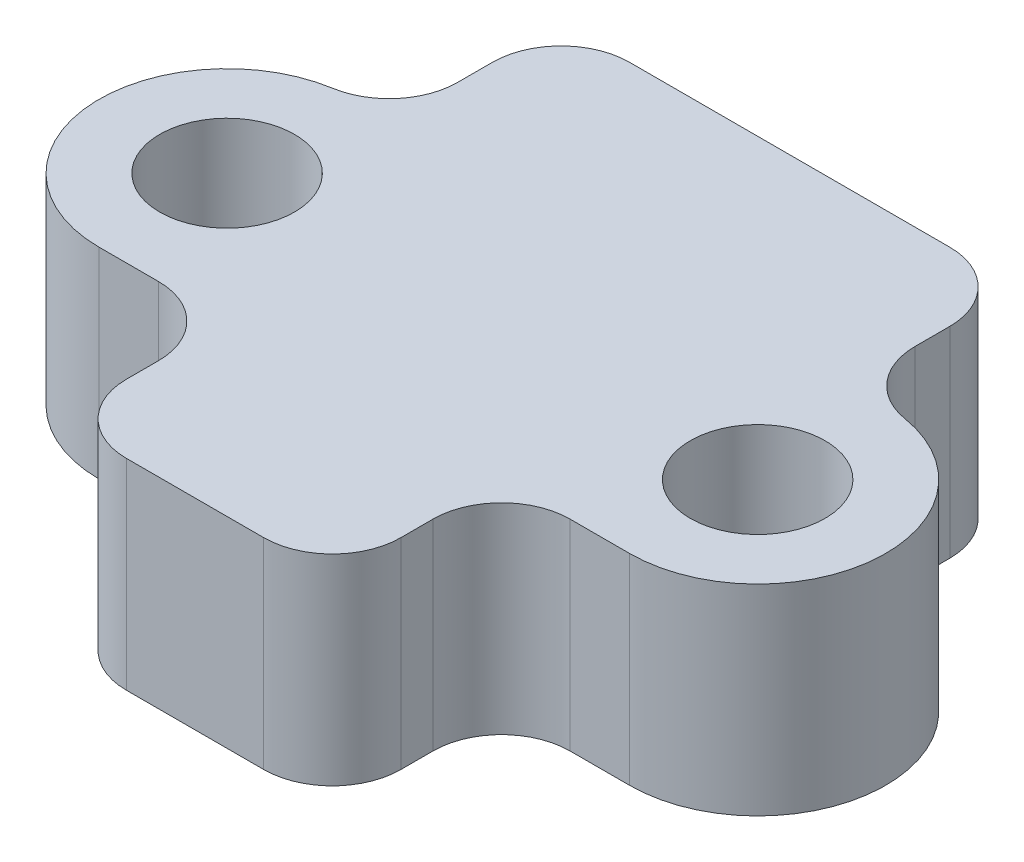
ISO-10303-21;
HEADER;
FILE_DESCRIPTION(('STEP AP214'),'2;1');
FILE_NAME('part.step','',(''),(''),'','','');
FILE_SCHEMA(('AUTOMOTIVE_DESIGN { 1 0 10303 214 1 1 1 1 }'));
ENDSEC;
DATA;
#1=APPLICATION_CONTEXT('core data for automotive mechanical design processes');
#2=APPLICATION_PROTOCOL_DEFINITION('international standard','automotive_design',2000,#1);
#3=PRODUCT_CONTEXT('',#1,'mechanical');
#4=PRODUCT('Part','Part','',(#3));
#5=PRODUCT_RELATED_PRODUCT_CATEGORY('part','',(#4));
#6=PRODUCT_DEFINITION_FORMATION('','',#4);
#7=PRODUCT_DEFINITION_CONTEXT('part definition',#1,'design');
#8=PRODUCT_DEFINITION('design','',#6,#7);
#9=PRODUCT_DEFINITION_SHAPE('','',#8);
#10=(LENGTH_UNIT() NAMED_UNIT(*) SI_UNIT(.MILLI.,.METRE.));
#11=(NAMED_UNIT(*) PLANE_ANGLE_UNIT() SI_UNIT($,.RADIAN.));
#12=(NAMED_UNIT(*) SI_UNIT($,.STERADIAN.) SOLID_ANGLE_UNIT());
#13=UNCERTAINTY_MEASURE_WITH_UNIT(LENGTH_MEASURE(1.E-05),#10,'distance_accuracy_value','');
#14=(GEOMETRIC_REPRESENTATION_CONTEXT(3) GLOBAL_UNCERTAINTY_ASSIGNED_CONTEXT((#13)) GLOBAL_UNIT_ASSIGNED_CONTEXT((#10,
#11,#12)) REPRESENTATION_CONTEXT('',''));
#15=CARTESIAN_POINT('',(0.,0.,0.));
#16=DIRECTION('',(0.,0.,1.));
#17=DIRECTION('',(1.,0.,0.));
#18=AXIS2_PLACEMENT_3D('',#15,#16,#17);
#19=CARTESIAN_POINT('',(-39.2,-5.5873454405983,4.42));
#20=DIRECTION('',(0.,0.,1.));
#21=DIRECTION('',(1.,0.,0.));
#22=AXIS2_PLACEMENT_3D('',#19,#20,#21);
#23=PLANE('',#22);
#24=DIRECTION('',(-1.,0.,0.));
#25=VECTOR('',#24,1.);
#26=CARTESIAN_POINT('',(-39.2,10.,4.42));
#27=LINE('',#26,#25);
#28=CARTESIAN_POINT('',(-40.7,10.,4.42));
#29=VERTEX_POINT('',#28);
#30=CARTESIAN_POINT('',(-43.7,10.,4.42));
#31=VERTEX_POINT('',#30);
#32=EDGE_CURVE('E273',#29,#31,#27,.T.);
#33=ORIENTED_EDGE('',*,*,#32,.F.);
#34=DIRECTION('',(0.,1.,0.));
#35=VECTOR('',#34,1.);
#36=CARTESIAN_POINT('',(-40.7,-5.5873454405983,4.42));
#37=LINE('',#36,#35);
#38=CARTESIAN_POINT('',(-40.7,14.391,4.42));
#39=VERTEX_POINT('',#38);
#40=EDGE_CURVE('E288',#29,#39,#37,.T.);
#41=ORIENTED_EDGE('',*,*,#40,.T.);
#42=DIRECTION('',(1.,0.,0.));
#43=VECTOR('',#42,1.);
#44=CARTESIAN_POINT('',(-39.2,14.391,4.42));
#45=LINE('',#44,#43);
#46=CARTESIAN_POINT('',(-43.7,14.391,4.42));
#47=VERTEX_POINT('',#46);
#48=EDGE_CURVE('E248',#47,#39,#45,.T.);
#49=ORIENTED_EDGE('',*,*,#48,.F.);
#50=DIRECTION('',(0.,1.,0.));
#51=VECTOR('',#50,1.);
#52=CARTESIAN_POINT('',(-43.7,-5.5873454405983,4.42));
#53=LINE('',#52,#51);
#54=EDGE_CURVE('E212',#31,#47,#53,.T.);
#55=ORIENTED_EDGE('',*,*,#54,.F.);
#56=EDGE_LOOP('',(#33,#41,#49,#55));
#57=FACE_BOUND('',#56,.T.);
#58=ADVANCED_FACE('F37',(#57),#23,.T.);
#59=CARTESIAN_POINT('',(-42.2,-5.5873454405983,-8.58));
#60=DIRECTION('',(0.,0.,-1.));
#61=DIRECTION('',(-1.,0.,0.));
#62=AXIS2_PLACEMENT_3D('',#59,#60,#61);
#63=PLANE('',#62);
#64=DIRECTION('',(-1.,0.,0.));
#65=VECTOR('',#64,1.);
#66=CARTESIAN_POINT('',(-42.2,14.391,-8.58));
#67=LINE('',#66,#65);
#68=CARTESIAN_POINT('',(-38.7,14.391,-8.58));
#69=VERTEX_POINT('',#68);
#70=CARTESIAN_POINT('',(-45.7,14.391,-8.58));
#71=VERTEX_POINT('',#70);
#72=EDGE_CURVE('E261',#69,#71,#67,.T.);
#73=ORIENTED_EDGE('',*,*,#72,.F.);
#74=DIRECTION('',(0.,1.,0.));
#75=VECTOR('',#74,1.);
#76=CARTESIAN_POINT('',(-38.7,-5.5873454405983,-8.58));
#77=LINE('',#76,#75);
#78=CARTESIAN_POINT('',(-38.7,10.,-8.58));
#79=VERTEX_POINT('',#78);
#80=EDGE_CURVE('E60',#69,#79,#77,.F.);
#81=ORIENTED_EDGE('',*,*,#80,.T.);
#82=DIRECTION('',(1.,0.,0.));
#83=VECTOR('',#82,1.);
#84=CARTESIAN_POINT('',(-42.2,10.,-8.58));
#85=LINE('',#84,#83);
#86=CARTESIAN_POINT('',(-45.7,10.,-8.58));
#87=VERTEX_POINT('',#86);
#88=EDGE_CURVE('E271',#87,#79,#85,.T.);
#89=ORIENTED_EDGE('',*,*,#88,.F.);
#90=DIRECTION('',(0.,1.,0.));
#91=VECTOR('',#90,1.);
#92=CARTESIAN_POINT('',(-45.7,-5.5873454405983,-8.58));
#93=LINE('',#92,#91);
#94=EDGE_CURVE('E232',#71,#87,#93,.F.);
#95=ORIENTED_EDGE('',*,*,#94,.F.);
#96=EDGE_LOOP('',(#73,#81,#89,#95));
#97=FACE_BOUND('',#96,.T.);
#98=ADVANCED_FACE('F368',(#97),#63,.T.);
#99=CARTESIAN_POINT('',(-37.2,-5.5873454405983,-8.58));
#100=DIRECTION('',(1.,0.,0.));
#101=DIRECTION('',(0.,0.,-1.));
#102=AXIS2_PLACEMENT_3D('',#99,#100,#101);
#103=PLANE('',#102);
#104=DIRECTION('',(0.,0.,-1.));
#105=VECTOR('',#104,1.);
#106=CARTESIAN_POINT('',(-37.2,14.391,-8.58));
#107=LINE('',#106,#105);
#108=CARTESIAN_POINT('',(-37.2,14.391,-6.32269187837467));
#109=VERTEX_POINT('',#108);
#110=CARTESIAN_POINT('',(-37.2,14.391,-7.08));
#111=VERTEX_POINT('',#110);
#112=EDGE_CURVE('E258',#109,#111,#107,.T.);
#113=ORIENTED_EDGE('',*,*,#112,.F.);
#114=DIRECTION('',(0.,-1.,0.));
#115=VECTOR('',#114,1.);
#116=CARTESIAN_POINT('',(-37.2,10.,-6.32269187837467));
#117=LINE('',#116,#115);
#118=CARTESIAN_POINT('',(-37.2,10.,-6.32269187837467));
#119=VERTEX_POINT('',#118);
#120=EDGE_CURVE('E286',#109,#119,#117,.T.);
#121=ORIENTED_EDGE('',*,*,#120,.T.);
#122=DIRECTION('',(0.,0.,1.));
#123=VECTOR('',#122,1.);
#124=CARTESIAN_POINT('',(-37.2,10.,-8.58));
#125=LINE('',#124,#123);
#126=CARTESIAN_POINT('',(-37.2,10.,-7.08));
#127=VERTEX_POINT('',#126);
#128=EDGE_CURVE('E268',#127,#119,#125,.T.);
#129=ORIENTED_EDGE('',*,*,#128,.F.);
#130=DIRECTION('',(0.,1.,0.));
#131=VECTOR('',#130,1.);
#132=CARTESIAN_POINT('',(-37.2,-5.5873454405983,-7.08));
#133=LINE('',#132,#131);
#134=EDGE_CURVE('E283',#127,#111,#133,.T.);
#135=ORIENTED_EDGE('',*,*,#134,.T.);
#136=EDGE_LOOP('',(#113,#121,#129,#135));
#137=FACE_BOUND('',#136,.T.);
#138=ADVANCED_FACE('F373',(#137),#103,.T.);
#139=CARTESIAN_POINT('',(-36.3996896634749,-5.5873454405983,-2.08));
#140=DIRECTION('',(0.,1.,0.));
#141=DIRECTION('',(0.,0.,1.));
#142=AXIS2_PLACEMENT_3D('',#139,#140,#141);
#143=CYLINDRICAL_SURFACE('',#142,2.8);
#144=CARTESIAN_POINT('',(-36.3996896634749,10.,-2.08));
#145=DIRECTION('',(0.,1.,0.));
#146=DIRECTION('',(0.,0.,1.));
#147=AXIS2_PLACEMENT_3D('',#144,#145,#146);
#148=CIRCLE('',#147,2.8);
#149=CARTESIAN_POINT('',(-35.9440777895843,10.,-4.8426830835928));
#150=VERTEX_POINT('',#149);
#151=CARTESIAN_POINT('',(-36.3996896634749,10.,0.720000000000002));
#152=VERTEX_POINT('',#151);
#153=EDGE_CURVE('E266',#150,#152,#148,.F.);
#154=ORIENTED_EDGE('',*,*,#153,.F.);
#155=DIRECTION('',(0.,1.,0.));
#156=VECTOR('',#155,1.);
#157=CARTESIAN_POINT('',(-35.9440777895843,-5.5873454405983,-4.84268308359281));
#158=LINE('',#157,#156);
#159=CARTESIAN_POINT('',(-35.9440777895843,14.391,-4.8426830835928));
#160=VERTEX_POINT('',#159);
#161=EDGE_CURVE('E280',#150,#160,#158,.T.);
#162=ORIENTED_EDGE('',*,*,#161,.T.);
#163=CARTESIAN_POINT('',(-36.3996896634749,14.391,-2.08));
#164=DIRECTION('',(0.,1.,0.));
#165=DIRECTION('',(0.,0.,-1.));
#166=AXIS2_PLACEMENT_3D('',#163,#164,#165);
#167=CIRCLE('',#166,2.8);
#168=CARTESIAN_POINT('',(-36.3996896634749,14.391,0.720000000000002));
#169=VERTEX_POINT('',#168);
#170=EDGE_CURVE('E255',#169,#160,#167,.T.);
#171=ORIENTED_EDGE('',*,*,#170,.F.);
#172=DIRECTION('',(0.,1.,0.));
#173=VECTOR('',#172,1.);
#174=CARTESIAN_POINT('',(-36.3996896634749,-5.5873454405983,0.720000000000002));
#175=LINE('',#174,#173);
#176=EDGE_CURVE('E263',#152,#169,#175,.T.);
#177=ORIENTED_EDGE('',*,*,#176,.F.);
#178=EDGE_LOOP('',(#154,#162,#171,#177));
#179=FACE_BOUND('',#178,.T.);
#180=ADVANCED_FACE('F405',(#179),#143,.T.);
#181=CARTESIAN_POINT('',(-39.2,-5.5873454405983,0.720000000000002));
#182=DIRECTION('',(0.,0.,1.));
#183=DIRECTION('',(1.,0.,0.));
#184=AXIS2_PLACEMENT_3D('',#181,#182,#183);
#185=PLANE('',#184);
#186=DIRECTION('',(1.,0.,0.));
#187=VECTOR('',#186,1.);
#188=CARTESIAN_POINT('',(-39.2,14.391,0.720000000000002));
#189=LINE('',#188,#187);
#190=CARTESIAN_POINT('',(-37.7,14.391,0.720000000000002));
#191=VERTEX_POINT('',#190);
#192=EDGE_CURVE('E253',#191,#169,#189,.T.);
#193=ORIENTED_EDGE('',*,*,#192,.F.);
#194=DIRECTION('',(0.,1.,0.));
#195=VECTOR('',#194,1.);
#196=CARTESIAN_POINT('',(-37.7,10.,0.720000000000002));
#197=LINE('',#196,#195);
#198=CARTESIAN_POINT('',(-37.7,10.,0.720000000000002));
#199=VERTEX_POINT('',#198);
#200=EDGE_CURVE('E52',#191,#199,#197,.F.);
#201=ORIENTED_EDGE('',*,*,#200,.T.);
#202=DIRECTION('',(-1.,0.,0.));
#203=VECTOR('',#202,1.);
#204=CARTESIAN_POINT('',(-39.2,10.,0.720000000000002));
#205=LINE('',#204,#203);
#206=EDGE_CURVE('E264',#152,#199,#205,.T.);
#207=ORIENTED_EDGE('',*,*,#206,.F.);
#208=ORIENTED_EDGE('',*,*,#176,.T.);
#209=EDGE_LOOP('',(#193,#201,#207,#208));
#210=FACE_BOUND('',#209,.T.);
#211=ADVANCED_FACE('F312',(#210),#185,.T.);
#212=CARTESIAN_POINT('',(-39.2,-5.5873454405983,0.720000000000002));
#213=DIRECTION('',(1.,0.,0.));
#214=DIRECTION('',(0.,0.,-1.));
#215=AXIS2_PLACEMENT_3D('',#212,#213,#214);
#216=PLANE('',#215);
#217=DIRECTION('',(0.,0.,-1.));
#218=VECTOR('',#217,1.);
#219=CARTESIAN_POINT('',(-39.2,14.391,0.720000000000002));
#220=LINE('',#219,#218);
#221=CARTESIAN_POINT('',(-39.2,14.391,2.92));
#222=VERTEX_POINT('',#221);
#223=CARTESIAN_POINT('',(-39.2,14.391,2.22));
#224=VERTEX_POINT('',#223);
#225=EDGE_CURVE('E250',#222,#224,#220,.T.);
#226=ORIENTED_EDGE('',*,*,#225,.F.);
#227=DIRECTION('',(0.,1.,0.));
#228=VECTOR('',#227,1.);
#229=CARTESIAN_POINT('',(-39.2,-5.5873454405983,2.92));
#230=LINE('',#229,#228);
#231=CARTESIAN_POINT('',(-39.2,10.,2.92));
#232=VERTEX_POINT('',#231);
#233=EDGE_CURVE('E298',#222,#232,#230,.F.);
#234=ORIENTED_EDGE('',*,*,#233,.T.);
#235=DIRECTION('',(0.,0.,1.));
#236=VECTOR('',#235,1.);
#237=CARTESIAN_POINT('',(-39.2,10.,0.720000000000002));
#238=LINE('',#237,#236);
#239=CARTESIAN_POINT('',(-39.2,10.,2.22));
#240=VERTEX_POINT('',#239);
#241=EDGE_CURVE('E275',#240,#232,#238,.T.);
#242=ORIENTED_EDGE('',*,*,#241,.F.);
#243=DIRECTION('',(0.,1.,0.));
#244=VECTOR('',#243,1.);
#245=CARTESIAN_POINT('',(-39.2,14.391,2.22));
#246=LINE('',#245,#244);
#247=EDGE_CURVE('E295',#240,#224,#246,.T.);
#248=ORIENTED_EDGE('',*,*,#247,.T.);
#249=EDGE_LOOP('',(#226,#234,#242,#248));
#250=FACE_BOUND('',#249,.T.);
#251=ADVANCED_FACE('F323',(#250),#216,.T.);
#252=CARTESIAN_POINT('',(0.,10.,0.));
#253=DIRECTION('',(0.,1.,0.));
#254=DIRECTION('',(0.,0.,1.));
#255=AXIS2_PLACEMENT_3D('',#252,#253,#254);
#256=PLANE('',#255);
#257=CARTESIAN_POINT('',(-36.3996896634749,10.,-2.08));
#258=DIRECTION('',(0.,1.,0.));
#259=DIRECTION('',(0.,0.,1.));
#260=AXIS2_PLACEMENT_3D('',#257,#258,#259);
#261=CIRCLE('',#260,1.47319999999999);
#262=CARTESIAN_POINT('',(-36.3996896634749,10.,-0.606800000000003));
#263=VERTEX_POINT('',#262);
#264=EDGE_CURVE('E245',#263,#263,#261,.T.);
#265=ORIENTED_EDGE('',*,*,#264,.T.);
#266=EDGE_LOOP('',(#265));
#267=FACE_BOUND('',#266,.T.);
#268=ORIENTED_EDGE('',*,*,#241,.T.);
#269=CARTESIAN_POINT('',(-40.7,10.,2.92));
#270=DIRECTION('',(0.,1.,0.));
#271=DIRECTION('',(0.,0.,1.));
#272=AXIS2_PLACEMENT_3D('',#269,#270,#271);
#273=CIRCLE('',#272,1.5);
#274=EDGE_CURVE('E302',#232,#29,#273,.F.);
#275=ORIENTED_EDGE('',*,*,#274,.T.);
#276=ORIENTED_EDGE('',*,*,#32,.T.);
#277=CARTESIAN_POINT('',(-43.7,10.,2.92));
#278=DIRECTION('',(0.,-1.,0.));
#279=DIRECTION('',(0.,0.,1.));
#280=AXIS2_PLACEMENT_3D('',#277,#278,#279);
#281=CIRCLE('',#280,1.5);
#282=CARTESIAN_POINT('',(-45.2,10.,2.92));
#283=VERTEX_POINT('',#282);
#284=EDGE_CURVE('E228',#283,#31,#281,.F.);
#285=ORIENTED_EDGE('',*,*,#284,.F.);
#286=DIRECTION('',(0.,0.,1.));
#287=VECTOR('',#286,1.);
#288=CARTESIAN_POINT('',(-45.2,10.,0.720000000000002));
#289=LINE('',#288,#287);
#290=CARTESIAN_POINT('',(-45.2,10.,2.22));
#291=VERTEX_POINT('',#290);
#292=EDGE_CURVE('E201',#291,#283,#289,.T.);
#293=ORIENTED_EDGE('',*,*,#292,.F.);
#294=CARTESIAN_POINT('',(-46.7,10.,2.22));
#295=DIRECTION('',(0.,-1.,0.));
#296=DIRECTION('',(0.,0.,1.));
#297=AXIS2_PLACEMENT_3D('',#294,#295,#296);
#298=CIRCLE('',#297,1.5);
#299=CARTESIAN_POINT('',(-46.7,10.,0.720000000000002));
#300=VERTEX_POINT('',#299);
#301=EDGE_CURVE('E240',#300,#291,#298,.T.);
#302=ORIENTED_EDGE('',*,*,#301,.F.);
#303=DIRECTION('',(1.,0.,0.));
#304=VECTOR('',#303,1.);
#305=CARTESIAN_POINT('',(-45.2,10.,0.720000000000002));
#306=LINE('',#305,#304);
#307=CARTESIAN_POINT('',(-48.0003103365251,10.,0.720000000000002));
#308=VERTEX_POINT('',#307);
#309=EDGE_CURVE('E192',#308,#300,#306,.T.);
#310=ORIENTED_EDGE('',*,*,#309,.F.);
#311=CARTESIAN_POINT('',(-48.0003103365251,10.,-2.08));
#312=DIRECTION('',(0.,-1.,0.));
#313=DIRECTION('',(0.,0.,1.));
#314=AXIS2_PLACEMENT_3D('',#311,#312,#313);
#315=CIRCLE('',#314,2.8);
#316=CARTESIAN_POINT('',(-48.4559222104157,10.,-4.8426830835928));
#317=VERTEX_POINT('',#316);
#318=EDGE_CURVE('E191',#317,#308,#315,.F.);
#319=ORIENTED_EDGE('',*,*,#318,.F.);
#320=CARTESIAN_POINT('',(-48.7,10.,-6.32269187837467));
#321=DIRECTION('',(0.,-1.,0.));
#322=DIRECTION('',(0.,0.,1.));
#323=AXIS2_PLACEMENT_3D('',#320,#321,#322);
#324=CIRCLE('',#323,1.5);
#325=CARTESIAN_POINT('',(-47.2,10.,-6.32269187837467));
#326=VERTEX_POINT('',#325);
#327=EDGE_CURVE('E236',#326,#317,#324,.T.);
#328=ORIENTED_EDGE('',*,*,#327,.F.);
#329=DIRECTION('',(0.,0.,1.));
#330=VECTOR('',#329,1.);
#331=CARTESIAN_POINT('',(-47.2,10.,-8.58));
#332=LINE('',#331,#330);
#333=CARTESIAN_POINT('',(-47.2,10.,-7.08));
#334=VERTEX_POINT('',#333);
#335=EDGE_CURVE('E199',#334,#326,#332,.T.);
#336=ORIENTED_EDGE('',*,*,#335,.F.);
#337=CARTESIAN_POINT('',(-45.7,10.,-7.08));
#338=DIRECTION('',(0.,-1.,0.));
#339=DIRECTION('',(0.,0.,1.));
#340=AXIS2_PLACEMENT_3D('',#337,#338,#339);
#341=CIRCLE('',#340,1.5);
#342=EDGE_CURVE('E226',#87,#334,#341,.F.);
#343=ORIENTED_EDGE('',*,*,#342,.F.);
#344=ORIENTED_EDGE('',*,*,#88,.T.);
#345=CARTESIAN_POINT('',(-38.7,10.,-7.08));
#346=DIRECTION('',(0.,1.,0.));
#347=DIRECTION('',(0.,0.,1.));
#348=AXIS2_PLACEMENT_3D('',#345,#346,#347);
#349=CIRCLE('',#348,1.5);
#350=EDGE_CURVE('E300',#79,#127,#349,.F.);
#351=ORIENTED_EDGE('',*,*,#350,.T.);
#352=ORIENTED_EDGE('',*,*,#128,.T.);
#353=CARTESIAN_POINT('',(-35.7,10.,-6.32269187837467));
#354=DIRECTION('',(0.,1.,0.));
#355=DIRECTION('',(0.,0.,1.));
#356=AXIS2_PLACEMENT_3D('',#353,#354,#355);
#357=CIRCLE('',#356,1.5);
#358=EDGE_CURVE('E308',#119,#150,#357,.T.);
#359=ORIENTED_EDGE('',*,*,#358,.T.);
#360=ORIENTED_EDGE('',*,*,#153,.T.);
#361=ORIENTED_EDGE('',*,*,#206,.T.);
#362=CARTESIAN_POINT('',(-37.7,10.,2.22));
#363=DIRECTION('',(0.,1.,0.));
#364=DIRECTION('',(0.,0.,1.));
#365=AXIS2_PLACEMENT_3D('',#362,#363,#364);
#366=CIRCLE('',#365,1.5);
#367=EDGE_CURVE('E11',#199,#240,#366,.T.);
#368=ORIENTED_EDGE('',*,*,#367,.T.);
#369=EDGE_LOOP('',(#268,#275,#276,#285,#293,#302,#310,#319,#328,#336,#343,#344,#351,#352,#359,
#360,#361,#368));
#370=FACE_BOUND('',#369,.T.);
#371=CARTESIAN_POINT('',(-48.0003103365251,10.,-2.08));
#372=DIRECTION('',(0.,-1.,0.));
#373=DIRECTION('',(0.,0.,1.));
#374=AXIS2_PLACEMENT_3D('',#371,#372,#373);
#375=CIRCLE('',#374,1.47319999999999);
#376=CARTESIAN_POINT('',(-48.0003103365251,10.,-0.606800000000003));
#377=VERTEX_POINT('',#376);
#378=EDGE_CURVE('E347',#377,#377,#375,.T.);
#379=ORIENTED_EDGE('',*,*,#378,.F.);
#380=EDGE_LOOP('',(#379));
#381=FACE_BOUND('',#380,.T.);
#382=ADVANCED_FACE('F319',(#267,#370,#381),#256,.F.);
#383=CARTESIAN_POINT('',(-36.3996896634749,14.391,-2.08));
#384=DIRECTION('',(0.,-1.,0.));
#385=DIRECTION('',(0.,0.,-1.));
#386=AXIS2_PLACEMENT_3D('',#383,#384,#385);
#387=PLANE('',#386);
#388=CARTESIAN_POINT('',(-36.3996896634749,14.391,-2.08));
#389=DIRECTION('',(0.,1.,0.));
#390=DIRECTION('',(0.,0.,1.));
#391=AXIS2_PLACEMENT_3D('',#388,#389,#390);
#392=CIRCLE('',#391,1.47319999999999);
#393=CARTESIAN_POINT('',(-36.3996896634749,14.391,-0.60680000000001));
#394=VERTEX_POINT('',#393);
#395=EDGE_CURVE('E242',#394,#394,#392,.T.);
#396=ORIENTED_EDGE('',*,*,#395,.F.);
#397=EDGE_LOOP('',(#396));
#398=FACE_BOUND('',#397,.T.);
#399=ORIENTED_EDGE('',*,*,#48,.T.);
#400=CARTESIAN_POINT('',(-40.7,14.391,2.92));
#401=DIRECTION('',(0.,-1.,0.));
#402=DIRECTION('',(0.,0.,-1.));
#403=AXIS2_PLACEMENT_3D('',#400,#401,#402);
#404=CIRCLE('',#403,1.5);
#405=EDGE_CURVE('E293',#39,#222,#404,.F.);
#406=ORIENTED_EDGE('',*,*,#405,.T.);
#407=ORIENTED_EDGE('',*,*,#225,.T.);
#408=CARTESIAN_POINT('',(-37.7,14.391,2.22));
#409=DIRECTION('',(0.,-1.,0.));
#410=DIRECTION('',(0.,0.,-1.));
#411=AXIS2_PLACEMENT_3D('',#408,#409,#410);
#412=CIRCLE('',#411,1.5);
#413=EDGE_CURVE('E45',#224,#191,#412,.T.);
#414=ORIENTED_EDGE('',*,*,#413,.T.);
#415=ORIENTED_EDGE('',*,*,#192,.T.);
#416=ORIENTED_EDGE('',*,*,#170,.T.);
#417=CARTESIAN_POINT('',(-35.7,14.391,-6.32269187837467));
#418=DIRECTION('',(0.,-1.,0.));
#419=DIRECTION('',(0.,0.,-1.));
#420=AXIS2_PLACEMENT_3D('',#417,#418,#419);
#421=CIRCLE('',#420,1.5);
#422=EDGE_CURVE('E306',#160,#109,#421,.T.);
#423=ORIENTED_EDGE('',*,*,#422,.T.);
#424=ORIENTED_EDGE('',*,*,#112,.T.);
#425=CARTESIAN_POINT('',(-38.7,14.391,-7.08));
#426=DIRECTION('',(0.,-1.,0.));
#427=DIRECTION('',(0.,0.,-1.));
#428=AXIS2_PLACEMENT_3D('',#425,#426,#427);
#429=CIRCLE('',#428,1.5);
#430=EDGE_CURVE('E291',#111,#69,#429,.F.);
#431=ORIENTED_EDGE('',*,*,#430,.T.);
#432=ORIENTED_EDGE('',*,*,#72,.T.);
#433=CARTESIAN_POINT('',(-45.7,14.391,-7.08));
#434=DIRECTION('',(0.,1.,0.));
#435=DIRECTION('',(0.,0.,-1.));
#436=AXIS2_PLACEMENT_3D('',#433,#434,#435);
#437=CIRCLE('',#436,1.5);
#438=CARTESIAN_POINT('',(-47.2,14.391,-7.08));
#439=VERTEX_POINT('',#438);
#440=EDGE_CURVE('E215',#439,#71,#437,.F.);
#441=ORIENTED_EDGE('',*,*,#440,.F.);
#442=DIRECTION('',(0.,0.,-1.));
#443=VECTOR('',#442,1.);
#444=CARTESIAN_POINT('',(-47.2,14.391,-8.58));
#445=LINE('',#444,#443);
#446=CARTESIAN_POINT('',(-47.2,14.391,-6.32269187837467));
#447=VERTEX_POINT('',#446);
#448=EDGE_CURVE('E187',#447,#439,#445,.T.);
#449=ORIENTED_EDGE('',*,*,#448,.F.);
#450=CARTESIAN_POINT('',(-48.7,14.391,-6.32269187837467));
#451=DIRECTION('',(0.,1.,0.));
#452=DIRECTION('',(0.,0.,-1.));
#453=AXIS2_PLACEMENT_3D('',#450,#451,#452);
#454=CIRCLE('',#453,1.5);
#455=CARTESIAN_POINT('',(-48.4559222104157,14.391,-4.8426830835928));
#456=VERTEX_POINT('',#455);
#457=EDGE_CURVE('E183',#456,#447,#454,.T.);
#458=ORIENTED_EDGE('',*,*,#457,.F.);
#459=CARTESIAN_POINT('',(-48.0003103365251,14.391,-2.08));
#460=DIRECTION('',(0.,-1.,0.));
#461=DIRECTION('',(0.,0.,-1.));
#462=AXIS2_PLACEMENT_3D('',#459,#460,#461);
#463=CIRCLE('',#462,2.8);
#464=CARTESIAN_POINT('',(-48.0003103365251,14.391,0.720000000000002));
#465=VERTEX_POINT('',#464);
#466=EDGE_CURVE('E175',#465,#456,#463,.T.);
#467=ORIENTED_EDGE('',*,*,#466,.F.);
#468=DIRECTION('',(-1.,0.,0.));
#469=VECTOR('',#468,1.);
#470=CARTESIAN_POINT('',(-45.2,14.391,0.720000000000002));
#471=LINE('',#470,#469);
#472=CARTESIAN_POINT('',(-46.7,14.391,0.720000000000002));
#473=VERTEX_POINT('',#472);
#474=EDGE_CURVE('E165',#473,#465,#471,.T.);
#475=ORIENTED_EDGE('',*,*,#474,.F.);
#476=CARTESIAN_POINT('',(-46.7,14.391,2.22));
#477=DIRECTION('',(0.,1.,0.));
#478=DIRECTION('',(0.,0.,-1.));
#479=AXIS2_PLACEMENT_3D('',#476,#477,#478);
#480=CIRCLE('',#479,1.5);
#481=CARTESIAN_POINT('',(-45.2,14.391,2.22));
#482=VERTEX_POINT('',#481);
#483=EDGE_CURVE('E238',#482,#473,#480,.T.);
#484=ORIENTED_EDGE('',*,*,#483,.F.);
#485=DIRECTION('',(0.,0.,-1.));
#486=VECTOR('',#485,1.);
#487=CARTESIAN_POINT('',(-45.2,14.391,0.720000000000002));
#488=LINE('',#487,#486);
#489=CARTESIAN_POINT('',(-45.2,14.391,2.92));
#490=VERTEX_POINT('',#489);
#491=EDGE_CURVE('E176',#490,#482,#488,.T.);
#492=ORIENTED_EDGE('',*,*,#491,.F.);
#493=CARTESIAN_POINT('',(-43.7,14.391,2.92));
#494=DIRECTION('',(0.,1.,0.));
#495=DIRECTION('',(0.,0.,-1.));
#496=AXIS2_PLACEMENT_3D('',#493,#494,#495);
#497=CIRCLE('',#496,1.5);
#498=EDGE_CURVE('E218',#47,#490,#497,.F.);
#499=ORIENTED_EDGE('',*,*,#498,.F.);
#500=EDGE_LOOP('',(#399,#406,#407,#414,#415,#416,#423,#424,#431,#432,#441,#449,#458,#467,#475,
#484,#492,#499));
#501=FACE_BOUND('',#500,.T.);
#502=CARTESIAN_POINT('',(-48.0003103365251,14.391,-2.08));
#503=DIRECTION('',(0.,-1.,0.));
#504=DIRECTION('',(0.,0.,1.));
#505=AXIS2_PLACEMENT_3D('',#502,#503,#504);
#506=CIRCLE('',#505,1.47319999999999);
#507=CARTESIAN_POINT('',(-48.0003103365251,14.391,-0.60680000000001));
#508=VERTEX_POINT('',#507);
#509=EDGE_CURVE('E350',#508,#508,#506,.T.);
#510=ORIENTED_EDGE('',*,*,#509,.T.);
#511=EDGE_LOOP('',(#510));
#512=FACE_BOUND('',#511,.T.);
#513=ADVANCED_FACE('F180',(#398,#501,#512),#387,.F.);
#514=CARTESIAN_POINT('',(-36.3996896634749,14.391,-2.08));
#515=DIRECTION('',(0.,1.,0.));
#516=DIRECTION('',(0.,0.,1.));
#517=AXIS2_PLACEMENT_3D('',#514,#515,#516);
#518=CYLINDRICAL_SURFACE('',#517,1.47319999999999);
#519=ORIENTED_EDGE('',*,*,#264,.F.);
#520=EDGE_LOOP('',(#519));
#521=FACE_BOUND('',#520,.T.);
#522=ORIENTED_EDGE('',*,*,#395,.T.);
#523=EDGE_LOOP('',(#522));
#524=FACE_BOUND('',#523,.T.);
#525=ADVANCED_FACE('F381',(#521,#524),#518,.F.);
#526=CARTESIAN_POINT('',(-35.7,-5.5873454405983,-6.32269187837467));
#527=DIRECTION('',(0.,1.,0.));
#528=DIRECTION('',(0.,0.,1.));
#529=AXIS2_PLACEMENT_3D('',#526,#527,#528);
#530=CYLINDRICAL_SURFACE('',#529,1.5);
#531=ORIENTED_EDGE('',*,*,#358,.F.);
#532=ORIENTED_EDGE('',*,*,#120,.F.);
#533=ORIENTED_EDGE('',*,*,#422,.F.);
#534=ORIENTED_EDGE('',*,*,#161,.F.);
#535=EDGE_LOOP('',(#531,#532,#533,#534));
#536=FACE_BOUND('',#535,.T.);
#537=ADVANCED_FACE('F378',(#536),#530,.F.);
#538=CARTESIAN_POINT('',(-40.7,-5.5873454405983,2.92));
#539=DIRECTION('',(0.,1.,0.));
#540=DIRECTION('',(0.,0.,1.));
#541=AXIS2_PLACEMENT_3D('',#538,#539,#540);
#542=CYLINDRICAL_SURFACE('',#541,1.5);
#543=ORIENTED_EDGE('',*,*,#274,.F.);
#544=ORIENTED_EDGE('',*,*,#233,.F.);
#545=ORIENTED_EDGE('',*,*,#405,.F.);
#546=ORIENTED_EDGE('',*,*,#40,.F.);
#547=EDGE_LOOP('',(#543,#544,#545,#546));
#548=FACE_BOUND('',#547,.T.);
#549=ADVANCED_FACE('F326',(#548),#542,.T.);
#550=CARTESIAN_POINT('',(-37.7,-5.5873454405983,2.22));
#551=DIRECTION('',(0.,-1.,0.));
#552=DIRECTION('',(0.,0.,-1.));
#553=AXIS2_PLACEMENT_3D('',#550,#551,#552);
#554=CYLINDRICAL_SURFACE('',#553,1.5);
#555=ORIENTED_EDGE('',*,*,#367,.F.);
#556=ORIENTED_EDGE('',*,*,#200,.F.);
#557=ORIENTED_EDGE('',*,*,#413,.F.);
#558=ORIENTED_EDGE('',*,*,#247,.F.);
#559=EDGE_LOOP('',(#555,#556,#557,#558));
#560=FACE_BOUND('',#559,.T.);
#561=ADVANCED_FACE('F316',(#560),#554,.F.);
#562=CARTESIAN_POINT('',(-38.7,-5.5873454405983,-7.08));
#563=DIRECTION('',(0.,1.,0.));
#564=DIRECTION('',(0.,0.,1.));
#565=AXIS2_PLACEMENT_3D('',#562,#563,#564);
#566=CYLINDRICAL_SURFACE('',#565,1.5);
#567=ORIENTED_EDGE('',*,*,#350,.F.);
#568=ORIENTED_EDGE('',*,*,#80,.F.);
#569=ORIENTED_EDGE('',*,*,#430,.F.);
#570=ORIENTED_EDGE('',*,*,#134,.F.);
#571=EDGE_LOOP('',(#567,#568,#569,#570));
#572=FACE_BOUND('',#571,.T.);
#573=ADVANCED_FACE('F39',(#572),#566,.T.);
#574=CARTESIAN_POINT('',(-47.2,-5.5873454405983,-8.58));
#575=DIRECTION('',(-1.,0.,0.));
#576=DIRECTION('',(0.,0.,-1.));
#577=AXIS2_PLACEMENT_3D('',#574,#575,#576);
#578=PLANE('',#577);
#579=ORIENTED_EDGE('',*,*,#448,.T.);
#580=DIRECTION('',(0.,1.,0.));
#581=VECTOR('',#580,1.);
#582=CARTESIAN_POINT('',(-47.2,-5.5873454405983,-7.08));
#583=LINE('',#582,#581);
#584=EDGE_CURVE('E206',#334,#439,#583,.T.);
#585=ORIENTED_EDGE('',*,*,#584,.F.);
#586=ORIENTED_EDGE('',*,*,#335,.T.);
#587=DIRECTION('',(0.,-1.,0.));
#588=VECTOR('',#587,1.);
#589=CARTESIAN_POINT('',(-47.2,10.,-6.32269187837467));
#590=LINE('',#589,#588);
#591=EDGE_CURVE('E209',#447,#326,#590,.T.);
#592=ORIENTED_EDGE('',*,*,#591,.F.);
#593=EDGE_LOOP('',(#579,#585,#586,#592));
#594=FACE_BOUND('',#593,.T.);
#595=ADVANCED_FACE('F388',(#594),#578,.T.);
#596=CARTESIAN_POINT('',(-48.0003103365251,-5.5873454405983,-2.08));
#597=DIRECTION('',(0.,1.,0.));
#598=DIRECTION('',(0.,0.,1.));
#599=AXIS2_PLACEMENT_3D('',#596,#597,#598);
#600=CYLINDRICAL_SURFACE('',#599,2.8);
#601=ORIENTED_EDGE('',*,*,#318,.T.);
#602=DIRECTION('',(0.,1.,0.));
#603=VECTOR('',#602,1.);
#604=CARTESIAN_POINT('',(-48.0003103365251,-5.5873454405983,0.720000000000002));
#605=LINE('',#604,#603);
#606=EDGE_CURVE('E170',#308,#465,#605,.T.);
#607=ORIENTED_EDGE('',*,*,#606,.T.);
#608=ORIENTED_EDGE('',*,*,#466,.T.);
#609=DIRECTION('',(0.,1.,0.));
#610=VECTOR('',#609,1.);
#611=CARTESIAN_POINT('',(-48.4559222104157,-5.5873454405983,-4.84268308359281));
#612=LINE('',#611,#610);
#613=EDGE_CURVE('E204',#317,#456,#612,.T.);
#614=ORIENTED_EDGE('',*,*,#613,.F.);
#615=EDGE_LOOP('',(#601,#607,#608,#614));
#616=FACE_BOUND('',#615,.T.);
#617=ADVANCED_FACE('F189',(#616),#600,.T.);
#618=CARTESIAN_POINT('',(-45.2,-5.5873454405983,0.720000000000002));
#619=DIRECTION('',(0.,0.,1.));
#620=DIRECTION('',(-1.,0.,0.));
#621=AXIS2_PLACEMENT_3D('',#618,#619,#620);
#622=PLANE('',#621);
#623=ORIENTED_EDGE('',*,*,#474,.T.);
#624=ORIENTED_EDGE('',*,*,#606,.F.);
#625=ORIENTED_EDGE('',*,*,#309,.T.);
#626=DIRECTION('',(0.,1.,0.));
#627=VECTOR('',#626,1.);
#628=CARTESIAN_POINT('',(-46.7,10.,0.720000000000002));
#629=LINE('',#628,#627);
#630=EDGE_CURVE('E173',#473,#300,#629,.F.);
#631=ORIENTED_EDGE('',*,*,#630,.F.);
#632=EDGE_LOOP('',(#623,#624,#625,#631));
#633=FACE_BOUND('',#632,.T.);
#634=ADVANCED_FACE('F167',(#633),#622,.T.);
#635=CARTESIAN_POINT('',(-45.2,-5.5873454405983,0.720000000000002));
#636=DIRECTION('',(-1.,0.,0.));
#637=DIRECTION('',(0.,0.,-1.));
#638=AXIS2_PLACEMENT_3D('',#635,#636,#637);
#639=PLANE('',#638);
#640=ORIENTED_EDGE('',*,*,#491,.T.);
#641=DIRECTION('',(0.,1.,0.));
#642=VECTOR('',#641,1.);
#643=CARTESIAN_POINT('',(-45.2,14.391,2.22));
#644=LINE('',#643,#642);
#645=EDGE_CURVE('E220',#291,#482,#644,.T.);
#646=ORIENTED_EDGE('',*,*,#645,.F.);
#647=ORIENTED_EDGE('',*,*,#292,.T.);
#648=DIRECTION('',(0.,1.,0.));
#649=VECTOR('',#648,1.);
#650=CARTESIAN_POINT('',(-45.2,-5.5873454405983,2.92));
#651=LINE('',#650,#649);
#652=EDGE_CURVE('E223',#490,#283,#651,.F.);
#653=ORIENTED_EDGE('',*,*,#652,.F.);
#654=EDGE_LOOP('',(#640,#646,#647,#653));
#655=FACE_BOUND('',#654,.T.);
#656=ADVANCED_FACE('F339',(#655),#639,.T.);
#657=CARTESIAN_POINT('',(-48.0003103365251,14.391,-2.08));
#658=DIRECTION('',(0.,1.,0.));
#659=DIRECTION('',(0.,0.,1.));
#660=AXIS2_PLACEMENT_3D('',#657,#658,#659);
#661=CYLINDRICAL_SURFACE('',#660,1.47319999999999);
#662=ORIENTED_EDGE('',*,*,#378,.T.);
#663=EDGE_LOOP('',(#662));
#664=FACE_BOUND('',#663,.T.);
#665=ORIENTED_EDGE('',*,*,#509,.F.);
#666=EDGE_LOOP('',(#665));
#667=FACE_BOUND('',#666,.T.);
#668=ADVANCED_FACE('F354',(#664,#667),#661,.F.);
#669=CARTESIAN_POINT('',(-48.7,-5.5873454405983,-6.32269187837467));
#670=DIRECTION('',(0.,1.,0.));
#671=DIRECTION('',(0.,0.,1.));
#672=AXIS2_PLACEMENT_3D('',#669,#670,#671);
#673=CYLINDRICAL_SURFACE('',#672,1.5);
#674=ORIENTED_EDGE('',*,*,#327,.T.);
#675=ORIENTED_EDGE('',*,*,#613,.T.);
#676=ORIENTED_EDGE('',*,*,#457,.T.);
#677=ORIENTED_EDGE('',*,*,#591,.T.);
#678=EDGE_LOOP('',(#674,#675,#676,#677));
#679=FACE_BOUND('',#678,.T.);
#680=ADVANCED_FACE('F356',(#679),#673,.F.);
#681=CARTESIAN_POINT('',(-43.7,-5.5873454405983,2.92));
#682=DIRECTION('',(0.,1.,0.));
#683=DIRECTION('',(0.,0.,1.));
#684=AXIS2_PLACEMENT_3D('',#681,#682,#683);
#685=CYLINDRICAL_SURFACE('',#684,1.5);
#686=ORIENTED_EDGE('',*,*,#284,.T.);
#687=ORIENTED_EDGE('',*,*,#54,.T.);
#688=ORIENTED_EDGE('',*,*,#498,.T.);
#689=ORIENTED_EDGE('',*,*,#652,.T.);
#690=EDGE_LOOP('',(#686,#687,#688,#689));
#691=FACE_BOUND('',#690,.T.);
#692=ADVANCED_FACE('F333',(#691),#685,.T.);
#693=CARTESIAN_POINT('',(-46.7,-5.5873454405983,2.22));
#694=DIRECTION('',(0.,-1.,0.));
#695=DIRECTION('',(0.,0.,-1.));
#696=AXIS2_PLACEMENT_3D('',#693,#694,#695);
#697=CYLINDRICAL_SURFACE('',#696,1.5);
#698=ORIENTED_EDGE('',*,*,#301,.T.);
#699=ORIENTED_EDGE('',*,*,#645,.T.);
#700=ORIENTED_EDGE('',*,*,#483,.T.);
#701=ORIENTED_EDGE('',*,*,#630,.T.);
#702=EDGE_LOOP('',(#698,#699,#700,#701));
#703=FACE_BOUND('',#702,.T.);
#704=ADVANCED_FACE('F342',(#703),#697,.F.);
#705=CARTESIAN_POINT('',(-45.7,-5.5873454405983,-7.08));
#706=DIRECTION('',(0.,1.,0.));
#707=DIRECTION('',(0.,0.,1.));
#708=AXIS2_PLACEMENT_3D('',#705,#706,#707);
#709=CYLINDRICAL_SURFACE('',#708,1.5);
#710=ORIENTED_EDGE('',*,*,#342,.T.);
#711=ORIENTED_EDGE('',*,*,#584,.T.);
#712=ORIENTED_EDGE('',*,*,#440,.T.);
#713=ORIENTED_EDGE('',*,*,#94,.T.);
#714=EDGE_LOOP('',(#710,#711,#712,#713));
#715=FACE_BOUND('',#714,.T.);
#716=ADVANCED_FACE('F408',(#715),#709,.T.);
#717=CLOSED_SHELL('',(#58,#98,#138,#180,#211,#251,#382,#513,#525,#537,#549,#561,#573,#595,#617,
#634,#656,#668,#680,#692,#704,#716));
#718=MANIFOLD_SOLID_BREP('B2',#717);
#719=ADVANCED_BREP_SHAPE_REPRESENTATION('',(#18,#718),#14);
#720=SHAPE_DEFINITION_REPRESENTATION(#9,#719);
ENDSEC;
END-ISO-10303-21;
